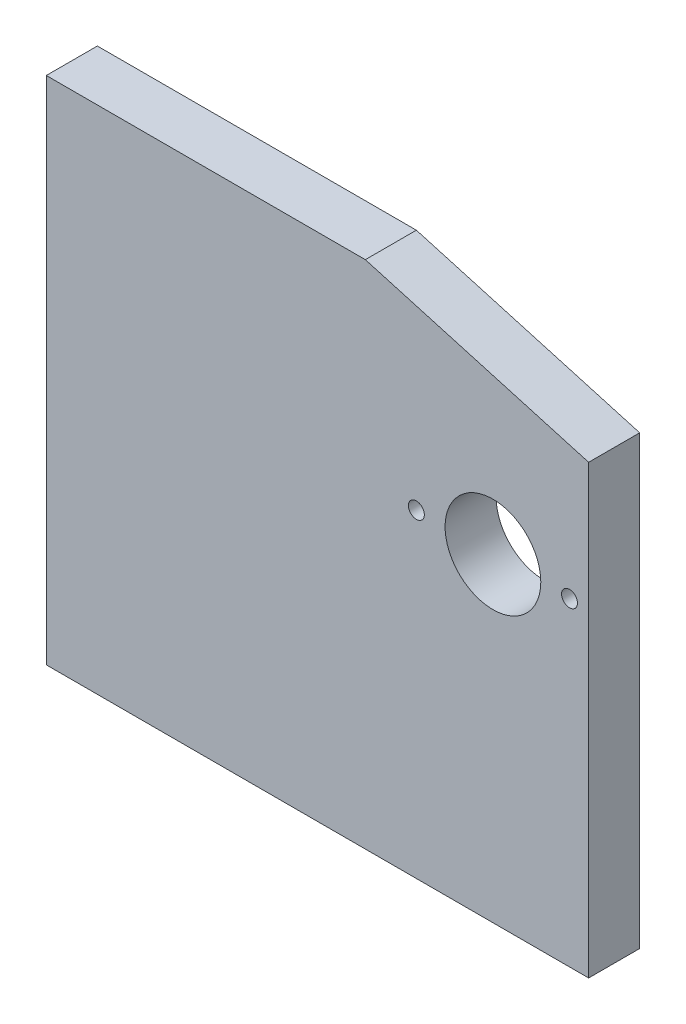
from build123d import *

# Parameters (mm, degrees)
BOSS_EXTRU_1_DEPTH                = 4
BOSS_EXTRU_1_DEPTH_BACK           = 4
ESQUISSE1_W                       = 85
ESQUISSE1_H                       = 80
ENL_V_MAT_EXTRU_1_DEPTH           = 59.908827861
DIAM_TRE_DU_PER_AGE_0_15_0_15_1_D = 15
TROU_TARAUD_M31_D                 = 2.5
R_P_TITION_LIN_AIRE1_COUNT        = 2
R_P_TITION_LIN_AIRE1_PITCH        = 24
TROU_TARAUD_M32_D                 = 2.5
TROU_TARAUD_M32_DEPTH             = 15
TROU_TARAUD_M32_TIP               = 0.751075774
TROU_TARAUD_M41_D                 = 3.3
TROU_TARAUD_M41_DEPTH             = 15
TROU_TARAUD_M41_TIP               = 0.991420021


with BuildPart() as part:
    # Esquisse1 → Boss.-Extru.1 (new, two sides: drawn at the far end of the back side and taken through both)
    with BuildSketch(Plane.XY.offset(-BOSS_EXTRU_1_DEPTH_BACK)):
        Rectangle(ESQUISSE1_W, ESQUISSE1_H)
    extrude(amount=BOSS_EXTRU_1_DEPTH + BOSS_EXTRU_1_DEPTH_BACK)

    # Esquisse2 → Enl_v. mat.-Extru.1 (cut, through all)
    with BuildSketch(Plane.XY.offset(4)):
        Polygon((7.5, 40), (42.5, 30), (42.5, 40), align=None)
    extrude(amount=-ENL_V_MAT_EXTRU_1_DEPTH, mode=Mode.SUBTRACT)

    # Diam_tre du per_age _0.15 _0.15_1 (through all)
    with Locations(Plane.XY.offset(4)):
        with Locations((27.5, 10)):
            Hole(DIAM_TRE_DU_PER_AGE_0_15_0_15_1_D / 2)

    # Trou taraud_ M31 (through all)
    with Locations(Plane.XY.offset(4)):
        with Locations((15.5, 10)):
            trou_taraud_m31 = Hole(TROU_TARAUD_M31_D / 2)

    # R_p_tition lin_aire1: Trou taraud_ M31 ×2
    with Locations(*[(i * R_P_TITION_LIN_AIRE1_PITCH, 0, 0) for i in range(1, R_P_TITION_LIN_AIRE1_COUNT)]):
        add(trou_taraud_m31, mode=Mode.SUBTRACT)

    # Trou taraud_ M32
    with Locations(Plane.ZY.offset(42.5)):
        with Locations((0, 25), (0, -25)):
            Hole(TROU_TARAUD_M32_D / 2, depth=TROU_TARAUD_M32_DEPTH)
            with Locations((0, 0, -(TROU_TARAUD_M32_DEPTH + TROU_TARAUD_M32_TIP / 2))):  # 118° drill point
                Cone(0, TROU_TARAUD_M32_D / 2, TROU_TARAUD_M32_TIP, mode=Mode.SUBTRACT)

    # Trou taraud_ M41
    with Locations(Plane(origin=(0, -40, 0), x_dir=(-1, 0, 0), z_dir=(0, -1, 0))):
        with Locations((-2.5, 0)):
            Hole(TROU_TARAUD_M41_D / 2, depth=TROU_TARAUD_M41_DEPTH)
            with Locations((0, 0, -(TROU_TARAUD_M41_DEPTH + TROU_TARAUD_M41_TIP / 2))):  # 118° drill point
                Cone(0, TROU_TARAUD_M41_D / 2, TROU_TARAUD_M41_TIP, mode=Mode.SUBTRACT)


solid = part.part
